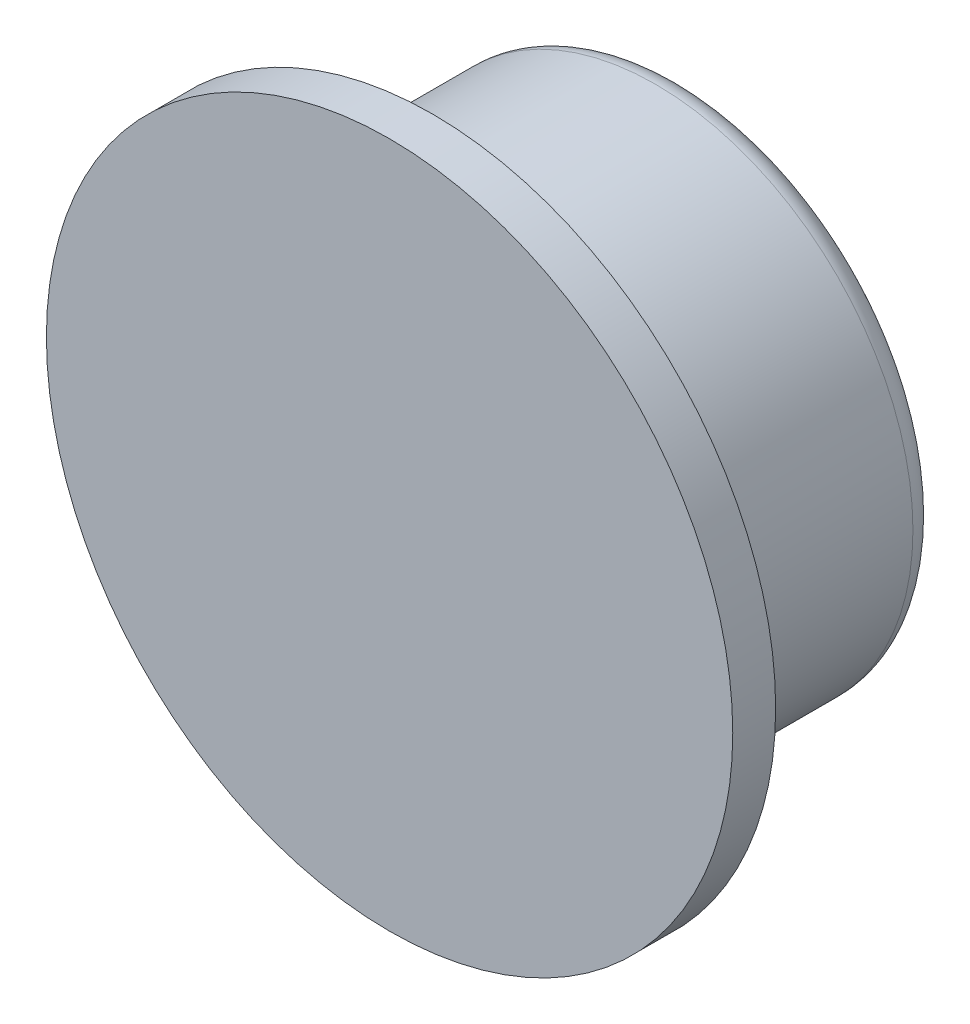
ISO-10303-21;
HEADER;
FILE_DESCRIPTION(('STEP AP214'),'2;1');
FILE_NAME('part.step','',(''),(''),'','','');
FILE_SCHEMA(('AUTOMOTIVE_DESIGN { 1 0 10303 214 1 1 1 1 }'));
ENDSEC;
DATA;
#1=APPLICATION_CONTEXT('core data for automotive mechanical design processes');
#2=APPLICATION_PROTOCOL_DEFINITION('international standard','automotive_design',2000,#1);
#3=PRODUCT_CONTEXT('',#1,'mechanical');
#4=PRODUCT('Part','Part','',(#3));
#5=PRODUCT_RELATED_PRODUCT_CATEGORY('part','',(#4));
#6=PRODUCT_DEFINITION_FORMATION('','',#4);
#7=PRODUCT_DEFINITION_CONTEXT('part definition',#1,'design');
#8=PRODUCT_DEFINITION('design','',#6,#7);
#9=PRODUCT_DEFINITION_SHAPE('','',#8);
#10=(LENGTH_UNIT() NAMED_UNIT(*) SI_UNIT(.MILLI.,.METRE.));
#11=(NAMED_UNIT(*) PLANE_ANGLE_UNIT() SI_UNIT($,.RADIAN.));
#12=(NAMED_UNIT(*) SI_UNIT($,.STERADIAN.) SOLID_ANGLE_UNIT());
#13=UNCERTAINTY_MEASURE_WITH_UNIT(LENGTH_MEASURE(1.E-05),#10,'distance_accuracy_value','');
#14=(GEOMETRIC_REPRESENTATION_CONTEXT(3) GLOBAL_UNCERTAINTY_ASSIGNED_CONTEXT((#13)) GLOBAL_UNIT_ASSIGNED_CONTEXT((#10,
#11,#12)) REPRESENTATION_CONTEXT('',''));
#15=CARTESIAN_POINT('',(0.,0.,0.));
#16=DIRECTION('',(0.,0.,1.));
#17=DIRECTION('',(1.,0.,0.));
#18=AXIS2_PLACEMENT_3D('',#15,#16,#17);
#19=CARTESIAN_POINT('',(0.,0.,0.));
#20=DIRECTION('',(0.,0.,-1.));
#21=DIRECTION('',(-1.,0.,0.));
#22=AXIS2_PLACEMENT_3D('',#19,#20,#21);
#23=PLANE('',#22);
#24=CARTESIAN_POINT('',(0.,0.,0.));
#25=DIRECTION('',(0.,0.,1.));
#26=DIRECTION('',(1.,0.,0.));
#27=AXIS2_PLACEMENT_3D('',#24,#25,#26);
#28=CIRCLE('',#27,40.);
#29=CARTESIAN_POINT('',(40.,0.,0.));
#30=VERTEX_POINT('',#29);
#31=EDGE_CURVE('E11',#30,#30,#28,.T.);
#32=ORIENTED_EDGE('',*,*,#31,.T.);
#33=EDGE_LOOP('',(#32));
#34=FACE_BOUND('',#33,.T.);
#35=ADVANCED_FACE('F32',(#34),#23,.F.);
#36=CARTESIAN_POINT('',(0.,0.,0.));
#37=DIRECTION('',(0.,0.,1.));
#38=DIRECTION('',(1.,0.,0.));
#39=AXIS2_PLACEMENT_3D('',#36,#37,#38);
#40=CYLINDRICAL_SURFACE('',#39,40.);
#41=ORIENTED_EDGE('',*,*,#31,.F.);
#42=EDGE_LOOP('',(#41));
#43=FACE_BOUND('',#42,.T.);
#44=CARTESIAN_POINT('',(0.,0.,-5.));
#45=DIRECTION('',(0.,0.,1.));
#46=DIRECTION('',(1.,0.,0.));
#47=AXIS2_PLACEMENT_3D('',#44,#45,#46);
#48=CIRCLE('',#47,40.);
#49=CARTESIAN_POINT('',(40.,0.,-5.));
#50=VERTEX_POINT('',#49);
#51=EDGE_CURVE('E38',#50,#50,#48,.T.);
#52=ORIENTED_EDGE('',*,*,#51,.T.);
#53=EDGE_LOOP('',(#52));
#54=FACE_BOUND('',#53,.T.);
#55=ADVANCED_FACE('F54',(#43,#54),#40,.T.);
#56=CARTESIAN_POINT('',(0.,40.,-5.));
#57=DIRECTION('',(0.,0.,1.));
#58=DIRECTION('',(1.,0.,0.));
#59=AXIS2_PLACEMENT_3D('',#56,#57,#58);
#60=PLANE('',#59);
#61=ORIENTED_EDGE('',*,*,#51,.F.);
#62=EDGE_LOOP('',(#61));
#63=FACE_BOUND('',#62,.T.);
#64=CARTESIAN_POINT('',(0.,0.,-5.));
#65=DIRECTION('',(0.,0.,1.));
#66=DIRECTION('',(1.,0.,0.));
#67=AXIS2_PLACEMENT_3D('',#64,#65,#66);
#68=CIRCLE('',#67,30.);
#69=CARTESIAN_POINT('',(30.,0.,-5.));
#70=VERTEX_POINT('',#69);
#71=EDGE_CURVE('E66',#70,#70,#68,.T.);
#72=ORIENTED_EDGE('',*,*,#71,.T.);
#73=EDGE_LOOP('',(#72));
#74=FACE_BOUND('',#73,.T.);
#75=ADVANCED_FACE('F59',(#63,#74),#60,.F.);
#76=CARTESIAN_POINT('',(0.,0.,0.));
#77=DIRECTION('',(0.,0.,1.));
#78=DIRECTION('',(1.,0.,0.));
#79=AXIS2_PLACEMENT_3D('',#76,#77,#78);
#80=CYLINDRICAL_SURFACE('',#79,30.);
#81=ORIENTED_EDGE('',*,*,#71,.F.);
#82=EDGE_LOOP('',(#81));
#83=FACE_BOUND('',#82,.T.);
#84=CARTESIAN_POINT('',(0.,0.,-31.));
#85=DIRECTION('',(0.,0.,1.));
#86=DIRECTION('',(1.,0.,0.));
#87=AXIS2_PLACEMENT_3D('',#84,#85,#86);
#88=CIRCLE('',#87,30.);
#89=CARTESIAN_POINT('',(30.,0.,-31.));
#90=VERTEX_POINT('',#89);
#91=EDGE_CURVE('E68',#90,#90,#88,.T.);
#92=ORIENTED_EDGE('',*,*,#91,.T.);
#93=EDGE_LOOP('',(#92));
#94=FACE_BOUND('',#93,.T.);
#95=ADVANCED_FACE('F101',(#83,#94),#80,.T.);
#96=CARTESIAN_POINT('',(0.,0.,-31.));
#97=DIRECTION('',(0.,0.,1.));
#98=DIRECTION('',(1.,0.,0.));
#99=AXIS2_PLACEMENT_3D('',#96,#97,#98);
#100=TOROIDAL_SURFACE('',#99,27.,3.);
#101=ORIENTED_EDGE('',*,*,#91,.F.);
#102=EDGE_LOOP('',(#101));
#103=FACE_BOUND('',#102,.T.);
#104=CARTESIAN_POINT('',(0.,0.,-34.));
#105=DIRECTION('',(0.,0.,1.));
#106=DIRECTION('',(1.,0.,0.));
#107=AXIS2_PLACEMENT_3D('',#104,#105,#106);
#108=CIRCLE('',#107,27.);
#109=CARTESIAN_POINT('',(27.,0.,-34.));
#110=VERTEX_POINT('',#109);
#111=EDGE_CURVE('E73',#110,#110,#108,.T.);
#112=ORIENTED_EDGE('',*,*,#111,.T.);
#113=EDGE_LOOP('',(#112));
#114=FACE_BOUND('',#113,.T.);
#115=ADVANCED_FACE('F94',(#103,#114),#100,.T.);
#116=CARTESIAN_POINT('',(0.,27.,-34.));
#117=DIRECTION('',(0.,0.,1.));
#118=DIRECTION('',(1.,0.,0.));
#119=AXIS2_PLACEMENT_3D('',#116,#117,#118);
#120=PLANE('',#119);
#121=ORIENTED_EDGE('',*,*,#111,.F.);
#122=EDGE_LOOP('',(#121));
#123=FACE_BOUND('',#122,.T.);
#124=CARTESIAN_POINT('',(0.,0.,-34.));
#125=DIRECTION('',(0.,0.,1.));
#126=DIRECTION('',(1.,0.,0.));
#127=AXIS2_PLACEMENT_3D('',#124,#125,#126);
#128=CIRCLE('',#127,5.5);
#129=CARTESIAN_POINT('',(5.5,0.,-34.));
#130=VERTEX_POINT('',#129);
#131=EDGE_CURVE('E76',#130,#130,#128,.T.);
#132=ORIENTED_EDGE('',*,*,#131,.T.);
#133=EDGE_LOOP('',(#132));
#134=FACE_BOUND('',#133,.T.);
#135=ADVANCED_FACE('F88',(#123,#134),#120,.F.);
#136=CARTESIAN_POINT('',(0.,0.,-33.5));
#137=DIRECTION('',(0.,0.,-1.));
#138=DIRECTION('',(-1.,0.,0.));
#139=AXIS2_PLACEMENT_3D('',#136,#137,#138);
#140=CONICAL_SURFACE('',#139,5.,0.785398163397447);
#141=ORIENTED_EDGE('',*,*,#131,.F.);
#142=EDGE_LOOP('',(#141));
#143=FACE_BOUND('',#142,.T.);
#144=CARTESIAN_POINT('',(0.,0.,-33.5));
#145=DIRECTION('',(0.,0.,1.));
#146=DIRECTION('',(1.,0.,0.));
#147=AXIS2_PLACEMENT_3D('',#144,#145,#146);
#148=CIRCLE('',#147,5.);
#149=CARTESIAN_POINT('',(5.,0.,-33.5));
#150=VERTEX_POINT('',#149);
#151=EDGE_CURVE('E79',#150,#150,#148,.T.);
#152=ORIENTED_EDGE('',*,*,#151,.T.);
#153=EDGE_LOOP('',(#152));
#154=FACE_BOUND('',#153,.T.);
#155=ADVANCED_FACE('F49',(#143,#154),#140,.F.);
#156=CARTESIAN_POINT('',(0.,0.,0.));
#157=DIRECTION('',(0.,0.,1.));
#158=DIRECTION('',(1.,0.,0.));
#159=AXIS2_PLACEMENT_3D('',#156,#157,#158);
#160=CYLINDRICAL_SURFACE('',#159,5.);
#161=ORIENTED_EDGE('',*,*,#151,.F.);
#162=EDGE_LOOP('',(#161));
#163=FACE_BOUND('',#162,.T.);
#164=CARTESIAN_POINT('',(0.,0.,-25.));
#165=DIRECTION('',(0.,0.,1.));
#166=DIRECTION('',(1.,0.,0.));
#167=AXIS2_PLACEMENT_3D('',#164,#165,#166);
#168=CIRCLE('',#167,5.);
#169=CARTESIAN_POINT('',(5.,0.,-25.));
#170=VERTEX_POINT('',#169);
#171=EDGE_CURVE('E82',#170,#170,#168,.T.);
#172=ORIENTED_EDGE('',*,*,#171,.T.);
#173=EDGE_LOOP('',(#172));
#174=FACE_BOUND('',#173,.T.);
#175=ADVANCED_FACE('F43',(#163,#174),#160,.F.);
#176=CARTESIAN_POINT('',(0.,0.,-22.1132486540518));
#177=DIRECTION('',(0.,0.,-1.));
#178=DIRECTION('',(-1.,0.,0.));
#179=AXIS2_PLACEMENT_3D('',#176,#177,#178);
#180=CONICAL_SURFACE('',#179,0.,1.04719755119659);
#181=ORIENTED_EDGE('',*,*,#171,.F.);
#182=EDGE_LOOP('',(#181));
#183=FACE_BOUND('',#182,.T.);
#184=CARTESIAN_POINT('',(0.,0.,-22.1132486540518));
#185=VERTEX_POINT('',#184);
#186=VERTEX_LOOP('',#185);
#187=FACE_BOUND('',#186,.T.);
#188=ADVANCED_FACE('F41',(#183,#187),#180,.F.);
#189=CLOSED_SHELL('',(#35,#55,#75,#95,#115,#135,#155,#175,#188));
#190=MANIFOLD_SOLID_BREP('B2',#189);
#191=ADVANCED_BREP_SHAPE_REPRESENTATION('',(#18,#190),#14);
#192=SHAPE_DEFINITION_REPRESENTATION(#9,#191);
ENDSEC;
END-ISO-10303-21;
